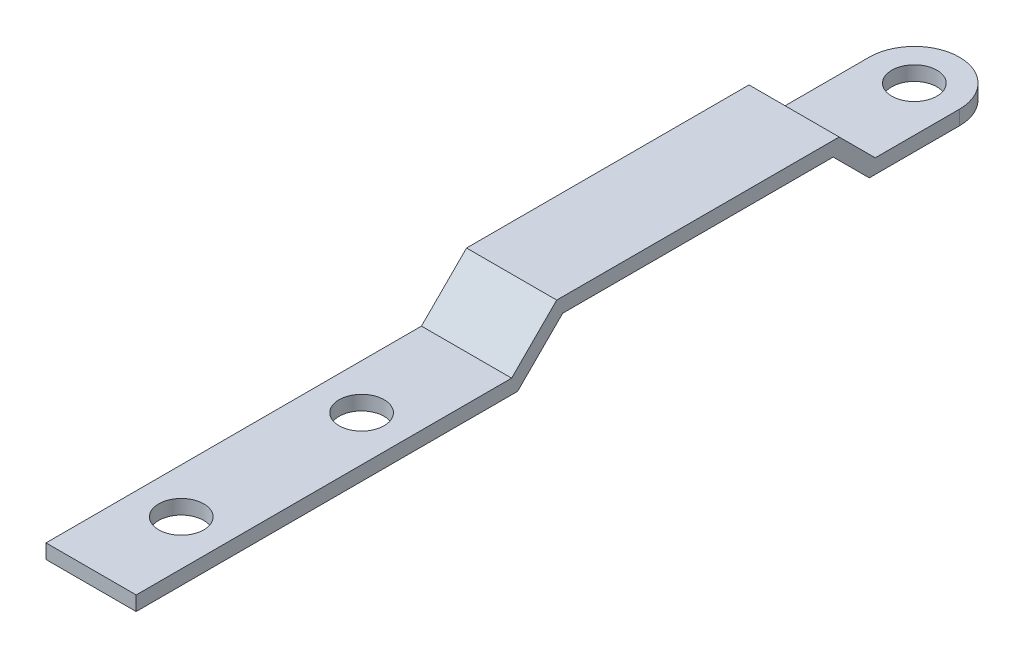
from build123d import *

# Parameters (mm, degrees)
EXTRU_MINCE1_DEPTH      = 5
CONG_1_RADIUS           = 5
CONG_1_LENGTH           = 1.6
ESQUISSE2_R             = 2.5
ENL_V_MAT_EXTRU_1_DEPTH = 97.512641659


with BuildPart() as part:
    # Esquisse1 → Extru.-Mince1 (new, symmetric)
    with BuildSketch(Plane(origin=(0, 0, 0), x_dir=(0, 0, -1), z_dir=(1, 0, 0))):
        Polygon((0, 0), (42.3, 0), (47.3, 5), (77.3, 5), (81.3, 1), (96.3, 1), (96.3, 2.6), (81.9627417, 2.6), (77.9627417, 6.6), (46.6372583, 6.6), (41.6372583, 1.6), (0, 1.6), align=None)
    extrude(amount=EXTRU_MINCE1_DEPTH, both=True)

    # Cong_1: full round fillet: the end face becomes a half cylinder, R = half its width
    cong_1_face = Plane((0, 1.8, -96.3), x_dir=(0, 1, 0), z_dir=(0, 0, -1))  # on the end face: x along it, z out of the body
    cong_1_slab = cong_1_face.offset(-CONG_1_RADIUS / 2) * Box(CONG_1_LENGTH, 2 * CONG_1_RADIUS, CONG_1_RADIUS, mode=Mode.PRIVATE)  # the body's end, R deep
    cong_1_round = Plane((0, 1.8, -91.3), x_dir=(0, 0, -1), z_dir=(0, 1, 0)) * Cylinder(CONG_1_RADIUS, CONG_1_LENGTH, mode=Mode.PRIVATE)  # its axis R under the face
    add(cong_1_slab - cong_1_round, mode=Mode.SUBTRACT)

    # Esquisse2 → Enl_v. mat.-Extru.1 (cut, through all)
    with BuildSketch(Plane(origin=(0, 2.6, 0), x_dir=(1, 0, 0), z_dir=(0, 1, 0))):
        with Locations(Location((0, 91.3, 0), (0, 0, 270))):
            Circle(ESQUISSE2_R)
        with Locations(Location((0, 30, 0), (0, 0, 270))):
            Circle(ESQUISSE2_R)
        with Locations(Location((0, 10, 0), (0, 0, 270))):
            Circle(ESQUISSE2_R)
    extrude(amount=-ENL_V_MAT_EXTRU_1_DEPTH, mode=Mode.SUBTRACT)


solid = part.part
